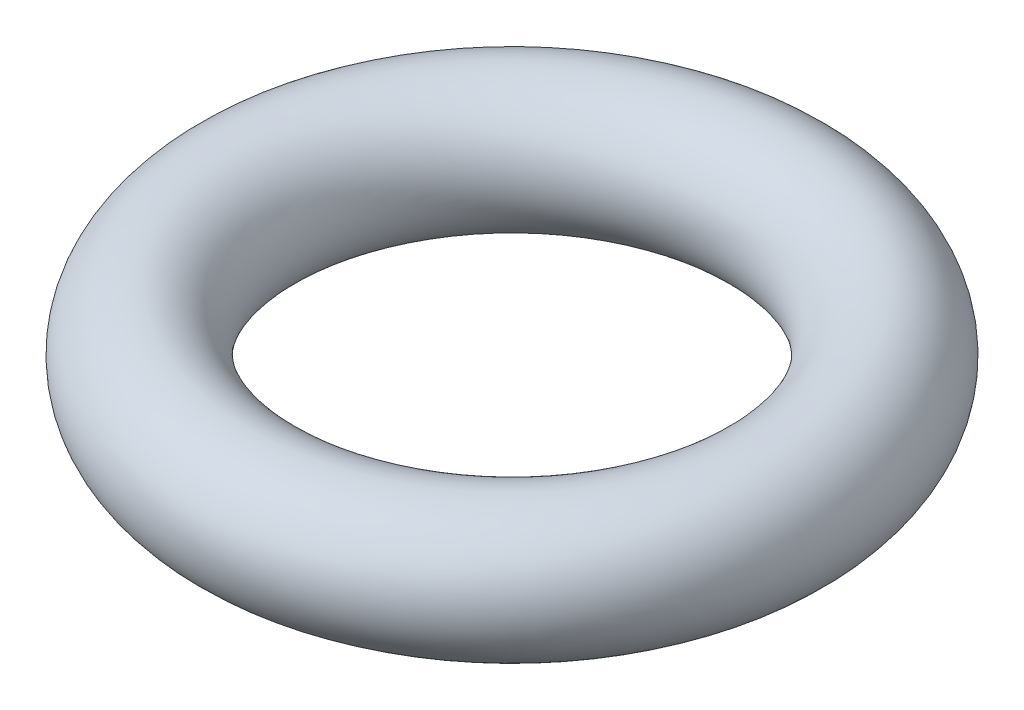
ISO-10303-21;
HEADER;
FILE_DESCRIPTION(('STEP AP214'),'2;1');
FILE_NAME('part.step','',(''),(''),'','','');
FILE_SCHEMA(('AUTOMOTIVE_DESIGN { 1 0 10303 214 1 1 1 1 }'));
ENDSEC;
DATA;
#1=APPLICATION_CONTEXT('core data for automotive mechanical design processes');
#2=APPLICATION_PROTOCOL_DEFINITION('international standard','automotive_design',2000,#1);
#3=PRODUCT_CONTEXT('',#1,'mechanical');
#4=PRODUCT('Part','Part','',(#3));
#5=PRODUCT_RELATED_PRODUCT_CATEGORY('part','',(#4));
#6=PRODUCT_DEFINITION_FORMATION('','',#4);
#7=PRODUCT_DEFINITION_CONTEXT('part definition',#1,'design');
#8=PRODUCT_DEFINITION('design','',#6,#7);
#9=PRODUCT_DEFINITION_SHAPE('','',#8);
#10=(LENGTH_UNIT() NAMED_UNIT(*) SI_UNIT(.MILLI.,.METRE.));
#11=(NAMED_UNIT(*) PLANE_ANGLE_UNIT() SI_UNIT($,.RADIAN.));
#12=(NAMED_UNIT(*) SI_UNIT($,.STERADIAN.) SOLID_ANGLE_UNIT());
#13=UNCERTAINTY_MEASURE_WITH_UNIT(LENGTH_MEASURE(1.E-05),#10,'distance_accuracy_value','');
#14=(GEOMETRIC_REPRESENTATION_CONTEXT(3) GLOBAL_UNCERTAINTY_ASSIGNED_CONTEXT((#13)) GLOBAL_UNIT_ASSIGNED_CONTEXT((#10,
#11,#12)) REPRESENTATION_CONTEXT('',''));
#15=CARTESIAN_POINT('',(0.,0.,0.));
#16=DIRECTION('',(0.,0.,1.));
#17=DIRECTION('',(1.,0.,0.));
#18=AXIS2_PLACEMENT_3D('',#15,#16,#17);
#19=CARTESIAN_POINT('',(0.,0.,0.));
#20=DIRECTION('',(0.,-1.,0.));
#21=DIRECTION('',(0.,0.,-1.));
#22=AXIS2_PLACEMENT_3D('',#19,#20,#21);
#23=TOROIDAL_SURFACE('',#22,2.,0.5);
#24=CARTESIAN_POINT('',(0.,0.,-2.5));
#25=VERTEX_POINT('',#24);
#26=VERTEX_LOOP('',#25);
#27=FACE_BOUND('',#26,.T.);
#28=ADVANCED_FACE('F32',(#27),#23,.T.);
#29=CLOSED_SHELL('',(#28));
#30=MANIFOLD_SOLID_BREP('B2',#29);
#31=ADVANCED_BREP_SHAPE_REPRESENTATION('',(#18,#30),#14);
#32=SHAPE_DEFINITION_REPRESENTATION(#9,#31);
ENDSEC;
END-ISO-10303-21;
